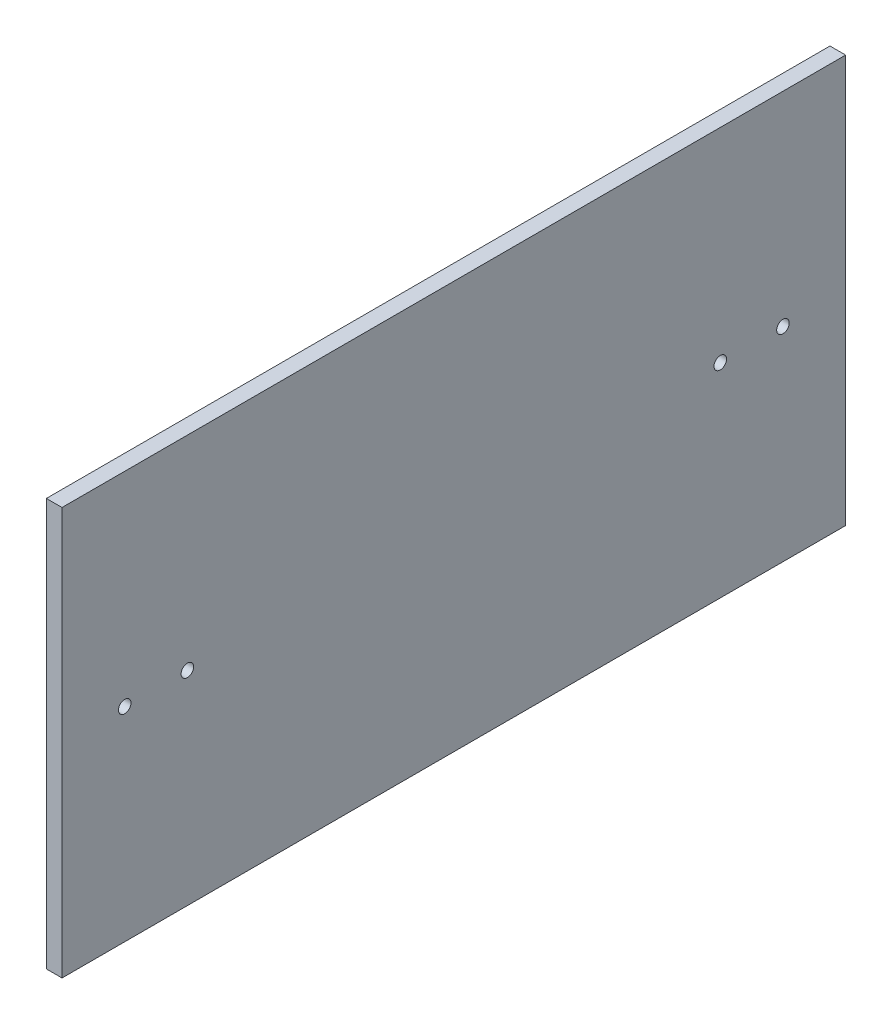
ISO-10303-21;
HEADER;
FILE_DESCRIPTION(('STEP AP214'),'2;1');
FILE_NAME('part.step','',(''),(''),'','','');
FILE_SCHEMA(('AUTOMOTIVE_DESIGN { 1 0 10303 214 1 1 1 1 }'));
ENDSEC;
DATA;
#1=APPLICATION_CONTEXT('core data for automotive mechanical design processes');
#2=APPLICATION_PROTOCOL_DEFINITION('international standard','automotive_design',2000,#1);
#3=PRODUCT_CONTEXT('',#1,'mechanical');
#4=PRODUCT('Part','Part','',(#3));
#5=PRODUCT_RELATED_PRODUCT_CATEGORY('part','',(#4));
#6=PRODUCT_DEFINITION_FORMATION('','',#4);
#7=PRODUCT_DEFINITION_CONTEXT('part definition',#1,'design');
#8=PRODUCT_DEFINITION('design','',#6,#7);
#9=PRODUCT_DEFINITION_SHAPE('','',#8);
#10=(LENGTH_UNIT() NAMED_UNIT(*) SI_UNIT(.MILLI.,.METRE.));
#11=(NAMED_UNIT(*) PLANE_ANGLE_UNIT() SI_UNIT($,.RADIAN.));
#12=(NAMED_UNIT(*) SI_UNIT($,.STERADIAN.) SOLID_ANGLE_UNIT());
#13=UNCERTAINTY_MEASURE_WITH_UNIT(LENGTH_MEASURE(1.E-05),#10,'distance_accuracy_value','');
#14=(GEOMETRIC_REPRESENTATION_CONTEXT(3) GLOBAL_UNCERTAINTY_ASSIGNED_CONTEXT((#13)) GLOBAL_UNIT_ASSIGNED_CONTEXT((#10,
#11,#12)) REPRESENTATION_CONTEXT('',''));
#15=CARTESIAN_POINT('',(0.,0.,0.));
#16=DIRECTION('',(0.,0.,1.));
#17=DIRECTION('',(1.,0.,0.));
#18=AXIS2_PLACEMENT_3D('',#15,#16,#17);
#19=CARTESIAN_POINT('',(6.35,0.,0.));
#20=DIRECTION('',(-1.,0.,0.));
#21=DIRECTION('',(0.,0.,1.));
#22=AXIS2_PLACEMENT_3D('',#19,#20,#21);
#23=PLANE('',#22);
#24=CARTESIAN_POINT('',(6.35,82.55,-50.8));
#25=DIRECTION('',(1.,0.,0.));
#26=DIRECTION('',(0.,0.,-1.));
#27=AXIS2_PLACEMENT_3D('',#24,#25,#26);
#28=CIRCLE('',#27,2.54);
#29=CARTESIAN_POINT('',(6.35,82.55,-53.34));
#30=VERTEX_POINT('',#29);
#31=EDGE_CURVE('E162',#30,#30,#28,.T.);
#32=ORIENTED_EDGE('',*,*,#31,.F.);
#33=EDGE_LOOP('',(#32));
#34=FACE_BOUND('',#33,.T.);
#35=CARTESIAN_POINT('',(6.35,82.55,-25.4));
#36=DIRECTION('',(1.,0.,0.));
#37=DIRECTION('',(0.,0.,-1.));
#38=AXIS2_PLACEMENT_3D('',#35,#36,#37);
#39=CIRCLE('',#38,2.54);
#40=CARTESIAN_POINT('',(6.35,82.55,-27.94));
#41=VERTEX_POINT('',#40);
#42=EDGE_CURVE('E168',#41,#41,#39,.T.);
#43=ORIENTED_EDGE('',*,*,#42,.F.);
#44=EDGE_LOOP('',(#43));
#45=FACE_BOUND('',#44,.T.);
#46=DIRECTION('',(0.,-1.,0.));
#47=VECTOR('',#46,1.);
#48=CARTESIAN_POINT('',(6.35,0.,0.));
#49=LINE('',#48,#47);
#50=CARTESIAN_POINT('',(6.35,165.1,0.));
#51=VERTEX_POINT('',#50);
#52=CARTESIAN_POINT('',(6.35,0.,0.));
#53=VERTEX_POINT('',#52);
#54=EDGE_CURVE('E99',#51,#53,#49,.T.);
#55=ORIENTED_EDGE('',*,*,#54,.T.);
#56=DIRECTION('',(0.,0.,-1.));
#57=VECTOR('',#56,1.);
#58=CARTESIAN_POINT('',(6.35,0.,0.));
#59=LINE('',#58,#57);
#60=CARTESIAN_POINT('',(6.35,0.,-317.5));
#61=VERTEX_POINT('',#60);
#62=EDGE_CURVE('E94',#53,#61,#59,.T.);
#63=ORIENTED_EDGE('',*,*,#62,.T.);
#64=DIRECTION('',(0.,1.,0.));
#65=VECTOR('',#64,1.);
#66=CARTESIAN_POINT('',(6.35,0.,-317.5));
#67=LINE('',#66,#65);
#68=CARTESIAN_POINT('',(6.35,165.1,-317.5));
#69=VERTEX_POINT('',#68);
#70=EDGE_CURVE('E97',#61,#69,#67,.T.);
#71=ORIENTED_EDGE('',*,*,#70,.T.);
#72=DIRECTION('',(0.,0.,1.));
#73=VECTOR('',#72,1.);
#74=CARTESIAN_POINT('',(6.35,165.1,0.));
#75=LINE('',#74,#73);
#76=EDGE_CURVE('E64',#69,#51,#75,.T.);
#77=ORIENTED_EDGE('',*,*,#76,.T.);
#78=EDGE_LOOP('',(#55,#63,#71,#77));
#79=FACE_BOUND('',#78,.T.);
#80=CARTESIAN_POINT('',(6.35,82.5499999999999,-266.7));
#81=DIRECTION('',(1.,0.,0.));
#82=DIRECTION('',(0.,0.,-1.));
#83=AXIS2_PLACEMENT_3D('',#80,#81,#82);
#84=CIRCLE('',#83,2.54000000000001);
#85=CARTESIAN_POINT('',(6.35,82.5499999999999,-269.24));
#86=VERTEX_POINT('',#85);
#87=EDGE_CURVE('E158',#86,#86,#84,.F.);
#88=ORIENTED_EDGE('',*,*,#87,.T.);
#89=EDGE_LOOP('',(#88));
#90=FACE_BOUND('',#89,.T.);
#91=CARTESIAN_POINT('',(6.35,82.5499999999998,-292.1));
#92=DIRECTION('',(1.,0.,0.));
#93=DIRECTION('',(0.,0.,-1.));
#94=AXIS2_PLACEMENT_3D('',#91,#92,#93);
#95=CIRCLE('',#94,2.54000000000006);
#96=CARTESIAN_POINT('',(6.35,82.5499999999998,-294.64));
#97=VERTEX_POINT('',#96);
#98=EDGE_CURVE('E135',#97,#97,#95,.F.);
#99=ORIENTED_EDGE('',*,*,#98,.T.);
#100=EDGE_LOOP('',(#99));
#101=FACE_BOUND('',#100,.T.);
#102=ADVANCED_FACE('F44',(#34,#45,#79,#90,#101),#23,.F.);
#103=CARTESIAN_POINT('',(0.,0.,0.));
#104=DIRECTION('',(-1.,0.,0.));
#105=DIRECTION('',(0.,0.,1.));
#106=AXIS2_PLACEMENT_3D('',#103,#104,#105);
#107=PLANE('',#106);
#108=CARTESIAN_POINT('',(0.,82.5499999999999,-266.7));
#109=DIRECTION('',(-1.,0.,0.));
#110=DIRECTION('',(0.,0.,1.));
#111=AXIS2_PLACEMENT_3D('',#108,#109,#110);
#112=CIRCLE('',#111,2.54000000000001);
#113=CARTESIAN_POINT('',(0.,82.5499999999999,-264.16));
#114=VERTEX_POINT('',#113);
#115=EDGE_CURVE('E138',#114,#114,#112,.F.);
#116=ORIENTED_EDGE('',*,*,#115,.T.);
#117=EDGE_LOOP('',(#116));
#118=FACE_BOUND('',#117,.T.);
#119=CARTESIAN_POINT('',(0.,82.55,-50.8));
#120=DIRECTION('',(-1.,0.,0.));
#121=DIRECTION('',(0.,0.,1.));
#122=AXIS2_PLACEMENT_3D('',#119,#120,#121);
#123=CIRCLE('',#122,2.54);
#124=CARTESIAN_POINT('',(0.,82.55,-48.26));
#125=VERTEX_POINT('',#124);
#126=EDGE_CURVE('E134',#125,#125,#123,.T.);
#127=ORIENTED_EDGE('',*,*,#126,.F.);
#128=EDGE_LOOP('',(#127));
#129=FACE_BOUND('',#128,.T.);
#130=CARTESIAN_POINT('',(0.,82.55,-25.4));
#131=DIRECTION('',(-1.,0.,0.));
#132=DIRECTION('',(0.,0.,1.));
#133=AXIS2_PLACEMENT_3D('',#130,#131,#132);
#134=CIRCLE('',#133,2.54);
#135=CARTESIAN_POINT('',(0.,82.55,-22.86));
#136=VERTEX_POINT('',#135);
#137=EDGE_CURVE('E130',#136,#136,#134,.T.);
#138=ORIENTED_EDGE('',*,*,#137,.F.);
#139=EDGE_LOOP('',(#138));
#140=FACE_BOUND('',#139,.T.);
#141=DIRECTION('',(0.,-1.,0.));
#142=VECTOR('',#141,1.);
#143=CARTESIAN_POINT('',(0.,0.,0.));
#144=LINE('',#143,#142);
#145=CARTESIAN_POINT('',(0.,165.1,0.));
#146=VERTEX_POINT('',#145);
#147=CARTESIAN_POINT('',(0.,0.,0.));
#148=VERTEX_POINT('',#147);
#149=EDGE_CURVE('E116',#146,#148,#144,.T.);
#150=ORIENTED_EDGE('',*,*,#149,.F.);
#151=DIRECTION('',(0.,0.,1.));
#152=VECTOR('',#151,1.);
#153=CARTESIAN_POINT('',(0.,165.1,0.));
#154=LINE('',#153,#152);
#155=CARTESIAN_POINT('',(0.,165.1,-317.5));
#156=VERTEX_POINT('',#155);
#157=EDGE_CURVE('E87',#156,#146,#154,.T.);
#158=ORIENTED_EDGE('',*,*,#157,.F.);
#159=DIRECTION('',(0.,1.,0.));
#160=VECTOR('',#159,1.);
#161=CARTESIAN_POINT('',(0.,0.,-317.5));
#162=LINE('',#161,#160);
#163=CARTESIAN_POINT('',(0.,0.,-317.5));
#164=VERTEX_POINT('',#163);
#165=EDGE_CURVE('E81',#164,#156,#162,.T.);
#166=ORIENTED_EDGE('',*,*,#165,.F.);
#167=DIRECTION('',(0.,0.,-1.));
#168=VECTOR('',#167,1.);
#169=CARTESIAN_POINT('',(0.,0.,0.));
#170=LINE('',#169,#168);
#171=EDGE_CURVE('E104',#148,#164,#170,.T.);
#172=ORIENTED_EDGE('',*,*,#171,.F.);
#173=EDGE_LOOP('',(#150,#158,#166,#172));
#174=FACE_BOUND('',#173,.T.);
#175=CARTESIAN_POINT('',(0.,82.5499999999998,-292.1));
#176=DIRECTION('',(-1.,0.,0.));
#177=DIRECTION('',(0.,0.,1.));
#178=AXIS2_PLACEMENT_3D('',#175,#176,#177);
#179=CIRCLE('',#178,2.54000000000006);
#180=CARTESIAN_POINT('',(0.,82.5499999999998,-289.56));
#181=VERTEX_POINT('',#180);
#182=EDGE_CURVE('E48',#181,#181,#179,.F.);
#183=ORIENTED_EDGE('',*,*,#182,.T.);
#184=EDGE_LOOP('',(#183));
#185=FACE_BOUND('',#184,.T.);
#186=ADVANCED_FACE('F147',(#118,#129,#140,#174,#185),#107,.T.);
#187=CARTESIAN_POINT('',(6.35,0.,0.));
#188=DIRECTION('',(0.,0.,-1.));
#189=DIRECTION('',(-1.,0.,0.));
#190=AXIS2_PLACEMENT_3D('',#187,#188,#189);
#191=PLANE('',#190);
#192=ORIENTED_EDGE('',*,*,#149,.T.);
#193=DIRECTION('',(-1.,0.,0.));
#194=VECTOR('',#193,1.);
#195=CARTESIAN_POINT('',(6.35,0.,0.));
#196=LINE('',#195,#194);
#197=EDGE_CURVE('E11',#53,#148,#196,.T.);
#198=ORIENTED_EDGE('',*,*,#197,.F.);
#199=ORIENTED_EDGE('',*,*,#54,.F.);
#200=DIRECTION('',(-1.,0.,0.));
#201=VECTOR('',#200,1.);
#202=CARTESIAN_POINT('',(6.35,165.1,0.));
#203=LINE('',#202,#201);
#204=EDGE_CURVE('E112',#51,#146,#203,.T.);
#205=ORIENTED_EDGE('',*,*,#204,.T.);
#206=EDGE_LOOP('',(#192,#198,#199,#205));
#207=FACE_BOUND('',#206,.T.);
#208=ADVANCED_FACE('F46',(#207),#191,.F.);
#209=CARTESIAN_POINT('',(6.35,0.,0.));
#210=DIRECTION('',(0.,1.,0.));
#211=DIRECTION('',(0.,0.,1.));
#212=AXIS2_PLACEMENT_3D('',#209,#210,#211);
#213=PLANE('',#212);
#214=ORIENTED_EDGE('',*,*,#171,.T.);
#215=DIRECTION('',(-1.,0.,0.));
#216=VECTOR('',#215,1.);
#217=CARTESIAN_POINT('',(6.35,0.,-317.5));
#218=LINE('',#217,#216);
#219=EDGE_CURVE('E55',#61,#164,#218,.T.);
#220=ORIENTED_EDGE('',*,*,#219,.F.);
#221=ORIENTED_EDGE('',*,*,#62,.F.);
#222=ORIENTED_EDGE('',*,*,#197,.T.);
#223=EDGE_LOOP('',(#214,#220,#221,#222));
#224=FACE_BOUND('',#223,.T.);
#225=ADVANCED_FACE('F103',(#224),#213,.F.);
#226=CARTESIAN_POINT('',(6.35,0.,-317.5));
#227=DIRECTION('',(0.,0.,1.));
#228=DIRECTION('',(1.,0.,0.));
#229=AXIS2_PLACEMENT_3D('',#226,#227,#228);
#230=PLANE('',#229);
#231=ORIENTED_EDGE('',*,*,#165,.T.);
#232=DIRECTION('',(-1.,0.,0.));
#233=VECTOR('',#232,1.);
#234=CARTESIAN_POINT('',(6.35,165.1,-317.5));
#235=LINE('',#234,#233);
#236=EDGE_CURVE('E106',#69,#156,#235,.T.);
#237=ORIENTED_EDGE('',*,*,#236,.F.);
#238=ORIENTED_EDGE('',*,*,#70,.F.);
#239=ORIENTED_EDGE('',*,*,#219,.T.);
#240=EDGE_LOOP('',(#231,#237,#238,#239));
#241=FACE_BOUND('',#240,.T.);
#242=ADVANCED_FACE('F108',(#241),#230,.F.);
#243=CARTESIAN_POINT('',(6.35,165.1,0.));
#244=DIRECTION('',(0.,-1.,0.));
#245=DIRECTION('',(0.,0.,-1.));
#246=AXIS2_PLACEMENT_3D('',#243,#244,#245);
#247=PLANE('',#246);
#248=ORIENTED_EDGE('',*,*,#157,.T.);
#249=ORIENTED_EDGE('',*,*,#204,.F.);
#250=ORIENTED_EDGE('',*,*,#76,.F.);
#251=ORIENTED_EDGE('',*,*,#236,.T.);
#252=EDGE_LOOP('',(#248,#249,#250,#251));
#253=FACE_BOUND('',#252,.T.);
#254=ADVANCED_FACE('F188',(#253),#247,.F.);
#255=CARTESIAN_POINT('',(-6.35,82.55,-25.4));
#256=DIRECTION('',(1.,0.,0.));
#257=DIRECTION('',(0.,0.,-1.));
#258=AXIS2_PLACEMENT_3D('',#255,#256,#257);
#259=CYLINDRICAL_SURFACE('',#258,2.54);
#260=ORIENTED_EDGE('',*,*,#137,.T.);
#261=EDGE_LOOP('',(#260));
#262=FACE_BOUND('',#261,.T.);
#263=ORIENTED_EDGE('',*,*,#42,.T.);
#264=EDGE_LOOP('',(#263));
#265=FACE_BOUND('',#264,.T.);
#266=ADVANCED_FACE('F174',(#262,#265),#259,.F.);
#267=CARTESIAN_POINT('',(-6.35,82.55,-50.8));
#268=DIRECTION('',(1.,0.,0.));
#269=DIRECTION('',(0.,0.,-1.));
#270=AXIS2_PLACEMENT_3D('',#267,#268,#269);
#271=CYLINDRICAL_SURFACE('',#270,2.54);
#272=ORIENTED_EDGE('',*,*,#126,.T.);
#273=EDGE_LOOP('',(#272));
#274=FACE_BOUND('',#273,.T.);
#275=ORIENTED_EDGE('',*,*,#31,.T.);
#276=EDGE_LOOP('',(#275));
#277=FACE_BOUND('',#276,.T.);
#278=ADVANCED_FACE('F236',(#274,#277),#271,.F.);
#279=CARTESIAN_POINT('',(-6.35,82.5499999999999,-266.7));
#280=DIRECTION('',(1.,0.,0.));
#281=DIRECTION('',(0.,0.,-1.));
#282=AXIS2_PLACEMENT_3D('',#279,#280,#281);
#283=CYLINDRICAL_SURFACE('',#282,2.54000000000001);
#284=ORIENTED_EDGE('',*,*,#115,.F.);
#285=EDGE_LOOP('',(#284));
#286=FACE_BOUND('',#285,.T.);
#287=ORIENTED_EDGE('',*,*,#87,.F.);
#288=EDGE_LOOP('',(#287));
#289=FACE_BOUND('',#288,.T.);
#290=ADVANCED_FACE('F152',(#286,#289),#283,.F.);
#291=CARTESIAN_POINT('',(-6.35,82.5499999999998,-292.1));
#292=DIRECTION('',(1.,0.,0.));
#293=DIRECTION('',(0.,0.,-1.));
#294=AXIS2_PLACEMENT_3D('',#291,#292,#293);
#295=CYLINDRICAL_SURFACE('',#294,2.54000000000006);
#296=ORIENTED_EDGE('',*,*,#182,.F.);
#297=EDGE_LOOP('',(#296));
#298=FACE_BOUND('',#297,.T.);
#299=ORIENTED_EDGE('',*,*,#98,.F.);
#300=EDGE_LOOP('',(#299));
#301=FACE_BOUND('',#300,.T.);
#302=ADVANCED_FACE('F149',(#298,#301),#295,.F.);
#303=CLOSED_SHELL('',(#102,#186,#208,#225,#242,#254,#266,#278,#290,#302));
#304=MANIFOLD_SOLID_BREP('B2',#303);
#305=ADVANCED_BREP_SHAPE_REPRESENTATION('',(#18,#304),#14);
#306=SHAPE_DEFINITION_REPRESENTATION(#9,#305);
ENDSEC;
END-ISO-10303-21;
